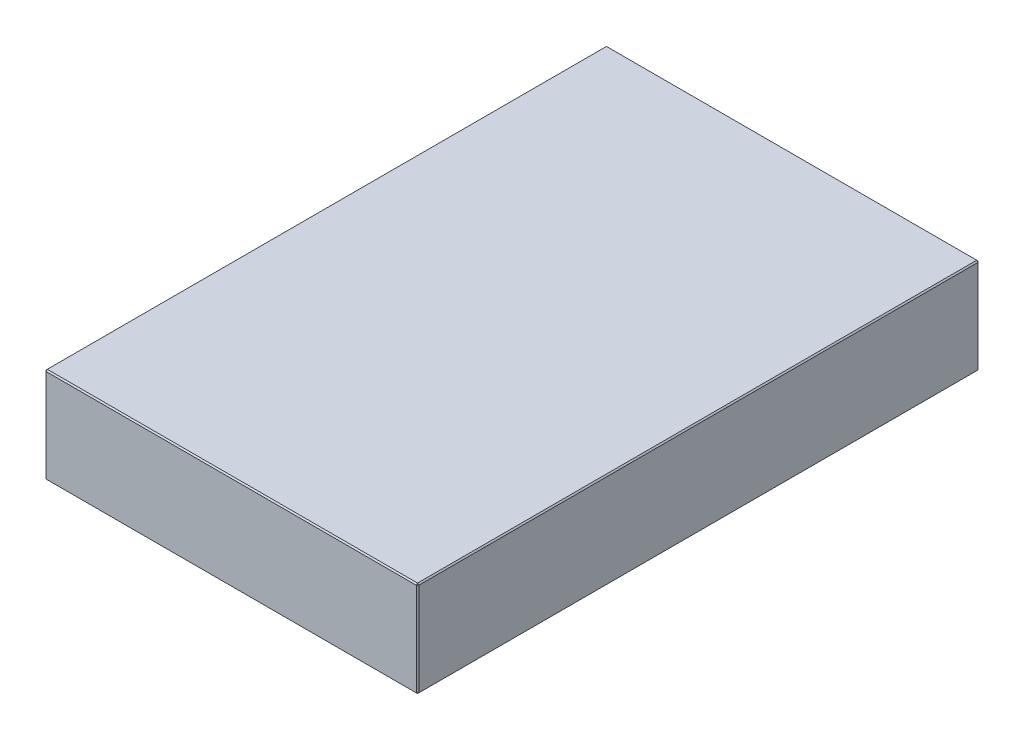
ISO-10303-21;
HEADER;
FILE_DESCRIPTION(('STEP AP214'),'2;1');
FILE_NAME('part.step','',(''),(''),'','','');
FILE_SCHEMA(('AUTOMOTIVE_DESIGN { 1 0 10303 214 1 1 1 1 }'));
ENDSEC;
DATA;
#1=APPLICATION_CONTEXT('core data for automotive mechanical design processes');
#2=APPLICATION_PROTOCOL_DEFINITION('international standard','automotive_design',2000,#1);
#3=PRODUCT_CONTEXT('',#1,'mechanical');
#4=PRODUCT('Part','Part','',(#3));
#5=PRODUCT_RELATED_PRODUCT_CATEGORY('part','',(#4));
#6=PRODUCT_DEFINITION_FORMATION('','',#4);
#7=PRODUCT_DEFINITION_CONTEXT('part definition',#1,'design');
#8=PRODUCT_DEFINITION('design','',#6,#7);
#9=PRODUCT_DEFINITION_SHAPE('','',#8);
#10=(LENGTH_UNIT() NAMED_UNIT(*) SI_UNIT(.MILLI.,.METRE.));
#11=(NAMED_UNIT(*) PLANE_ANGLE_UNIT() SI_UNIT($,.RADIAN.));
#12=(NAMED_UNIT(*) SI_UNIT($,.STERADIAN.) SOLID_ANGLE_UNIT());
#13=UNCERTAINTY_MEASURE_WITH_UNIT(LENGTH_MEASURE(1.E-05),#10,'distance_accuracy_value','');
#14=(GEOMETRIC_REPRESENTATION_CONTEXT(3) GLOBAL_UNCERTAINTY_ASSIGNED_CONTEXT((#13)) GLOBAL_UNIT_ASSIGNED_CONTEXT((#10,
#11,#12)) REPRESENTATION_CONTEXT('',''));
#15=CARTESIAN_POINT('',(0.,0.,0.));
#16=DIRECTION('',(0.,0.,1.));
#17=DIRECTION('',(1.,0.,0.));
#18=AXIS2_PLACEMENT_3D('',#15,#16,#17);
#19=CARTESIAN_POINT('',(-148.,76.,223.));
#20=DIRECTION('',(1.,0.,0.));
#21=DIRECTION('',(0.,0.,-1.));
#22=AXIS2_PLACEMENT_3D('',#19,#20,#21);
#23=PLANE('',#22);
#24=DIRECTION('',(0.,-1.,0.));
#25=VECTOR('',#24,1.);
#26=CARTESIAN_POINT('',(-148.,76.,-222.));
#27=LINE('',#26,#25);
#28=CARTESIAN_POINT('',(-148.,75.,-222.));
#29=VERTEX_POINT('',#28);
#30=CARTESIAN_POINT('',(-148.,1.,-222.));
#31=VERTEX_POINT('',#30);
#32=EDGE_CURVE('E114',#29,#31,#27,.T.);
#33=ORIENTED_EDGE('',*,*,#32,.T.);
#34=DIRECTION('',(0.,0.,1.));
#35=VECTOR('',#34,1.);
#36=CARTESIAN_POINT('',(-148.,1.,223.));
#37=LINE('',#36,#35);
#38=CARTESIAN_POINT('',(-148.,1.,222.));
#39=VERTEX_POINT('',#38);
#40=EDGE_CURVE('E110',#31,#39,#37,.T.);
#41=ORIENTED_EDGE('',*,*,#40,.T.);
#42=DIRECTION('',(0.,1.,0.));
#43=VECTOR('',#42,1.);
#44=CARTESIAN_POINT('',(-148.,76.,222.));
#45=LINE('',#44,#43);
#46=CARTESIAN_POINT('',(-148.,75.,222.));
#47=VERTEX_POINT('',#46);
#48=EDGE_CURVE('E103',#39,#47,#45,.T.);
#49=ORIENTED_EDGE('',*,*,#48,.T.);
#50=DIRECTION('',(0.,0.,-1.));
#51=VECTOR('',#50,1.);
#52=CARTESIAN_POINT('',(-148.,75.,-223.));
#53=LINE('',#52,#51);
#54=EDGE_CURVE('E107',#47,#29,#53,.T.);
#55=ORIENTED_EDGE('',*,*,#54,.T.);
#56=EDGE_LOOP('',(#33,#41,#49,#55));
#57=FACE_BOUND('',#56,.T.);
#58=ADVANCED_FACE('F15',(#57),#23,.F.);
#59=CARTESIAN_POINT('',(148.,76.,223.));
#60=DIRECTION('',(0.,0.,-1.));
#61=DIRECTION('',(-1.,0.,0.));
#62=AXIS2_PLACEMENT_3D('',#59,#60,#61);
#63=PLANE('',#62);
#64=DIRECTION('',(-1.,0.,0.));
#65=VECTOR('',#64,1.);
#66=CARTESIAN_POINT('',(-148.,75.,223.));
#67=LINE('',#66,#65);
#68=CARTESIAN_POINT('',(147.,75.,223.));
#69=VERTEX_POINT('',#68);
#70=CARTESIAN_POINT('',(-147.,75.,223.));
#71=VERTEX_POINT('',#70);
#72=EDGE_CURVE('E164',#69,#71,#67,.T.);
#73=ORIENTED_EDGE('',*,*,#72,.T.);
#74=DIRECTION('',(0.,-1.,0.));
#75=VECTOR('',#74,1.);
#76=CARTESIAN_POINT('',(-147.,76.,223.));
#77=LINE('',#76,#75);
#78=CARTESIAN_POINT('',(-147.,1.00000000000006,223.));
#79=VERTEX_POINT('',#78);
#80=EDGE_CURVE('E122',#71,#79,#77,.T.);
#81=ORIENTED_EDGE('',*,*,#80,.T.);
#82=DIRECTION('',(1.,0.,0.));
#83=VECTOR('',#82,1.);
#84=CARTESIAN_POINT('',(148.,1.00000000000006,223.));
#85=LINE('',#84,#83);
#86=CARTESIAN_POINT('',(147.,1.00000000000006,223.));
#87=VERTEX_POINT('',#86);
#88=EDGE_CURVE('E168',#79,#87,#85,.T.);
#89=ORIENTED_EDGE('',*,*,#88,.T.);
#90=DIRECTION('',(0.,1.,0.));
#91=VECTOR('',#90,1.);
#92=CARTESIAN_POINT('',(147.,76.,223.));
#93=LINE('',#92,#91);
#94=EDGE_CURVE('E166',#87,#69,#93,.T.);
#95=ORIENTED_EDGE('',*,*,#94,.T.);
#96=EDGE_LOOP('',(#73,#81,#89,#95));
#97=FACE_BOUND('',#96,.T.);
#98=ADVANCED_FACE('F275',(#97),#63,.F.);
#99=CARTESIAN_POINT('',(148.,76.,223.));
#100=DIRECTION('',(-1.,0.,0.));
#101=DIRECTION('',(0.,0.,1.));
#102=AXIS2_PLACEMENT_3D('',#99,#100,#101);
#103=PLANE('',#102);
#104=DIRECTION('',(0.,0.,-1.));
#105=VECTOR('',#104,1.);
#106=CARTESIAN_POINT('',(148.,1.00000000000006,223.));
#107=LINE('',#106,#105);
#108=CARTESIAN_POINT('',(148.,1.00000000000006,222.));
#109=VERTEX_POINT('',#108);
#110=CARTESIAN_POINT('',(148.,1.00000000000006,-222.));
#111=VERTEX_POINT('',#110);
#112=EDGE_CURVE('E159',#109,#111,#107,.T.);
#113=ORIENTED_EDGE('',*,*,#112,.T.);
#114=DIRECTION('',(0.,1.,0.));
#115=VECTOR('',#114,1.);
#116=CARTESIAN_POINT('',(148.,76.,-222.));
#117=LINE('',#116,#115);
#118=CARTESIAN_POINT('',(148.,75.,-222.));
#119=VERTEX_POINT('',#118);
#120=EDGE_CURVE('E161',#111,#119,#117,.T.);
#121=ORIENTED_EDGE('',*,*,#120,.T.);
#122=DIRECTION('',(0.,0.,1.));
#123=VECTOR('',#122,1.);
#124=CARTESIAN_POINT('',(148.,75.,223.));
#125=LINE('',#124,#123);
#126=CARTESIAN_POINT('',(148.,75.,222.));
#127=VERTEX_POINT('',#126);
#128=EDGE_CURVE('E155',#119,#127,#125,.T.);
#129=ORIENTED_EDGE('',*,*,#128,.T.);
#130=DIRECTION('',(0.,-1.,0.));
#131=VECTOR('',#130,1.);
#132=CARTESIAN_POINT('',(148.,76.,222.));
#133=LINE('',#132,#131);
#134=EDGE_CURVE('E157',#127,#109,#133,.T.);
#135=ORIENTED_EDGE('',*,*,#134,.T.);
#136=EDGE_LOOP('',(#113,#121,#129,#135));
#137=FACE_BOUND('',#136,.T.);
#138=ADVANCED_FACE('F254',(#137),#103,.F.);
#139=CARTESIAN_POINT('',(148.,76.,-223.));
#140=DIRECTION('',(0.,0.,1.));
#141=DIRECTION('',(1.,0.,0.));
#142=AXIS2_PLACEMENT_3D('',#139,#140,#141);
#143=PLANE('',#142);
#144=DIRECTION('',(0.,-1.,0.));
#145=VECTOR('',#144,1.);
#146=CARTESIAN_POINT('',(147.,76.,-223.));
#147=LINE('',#146,#145);
#148=CARTESIAN_POINT('',(147.,75.,-223.));
#149=VERTEX_POINT('',#148);
#150=CARTESIAN_POINT('',(147.,1.00000000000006,-223.));
#151=VERTEX_POINT('',#150);
#152=EDGE_CURVE('E148',#149,#151,#147,.T.);
#153=ORIENTED_EDGE('',*,*,#152,.T.);
#154=DIRECTION('',(-1.,0.,0.));
#155=VECTOR('',#154,1.);
#156=CARTESIAN_POINT('',(148.,1.00000000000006,-223.));
#157=LINE('',#156,#155);
#158=CARTESIAN_POINT('',(-147.,1.00000000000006,-223.));
#159=VERTEX_POINT('',#158);
#160=EDGE_CURVE('E153',#151,#159,#157,.T.);
#161=ORIENTED_EDGE('',*,*,#160,.T.);
#162=DIRECTION('',(0.,1.,0.));
#163=VECTOR('',#162,1.);
#164=CARTESIAN_POINT('',(-147.,76.,-223.));
#165=LINE('',#164,#163);
#166=CARTESIAN_POINT('',(-147.,75.,-223.));
#167=VERTEX_POINT('',#166);
#168=EDGE_CURVE('E150',#159,#167,#165,.T.);
#169=ORIENTED_EDGE('',*,*,#168,.T.);
#170=DIRECTION('',(1.,0.,0.));
#171=VECTOR('',#170,1.);
#172=CARTESIAN_POINT('',(148.,75.,-223.));
#173=LINE('',#172,#171);
#174=EDGE_CURVE('E146',#167,#149,#173,.T.);
#175=ORIENTED_EDGE('',*,*,#174,.T.);
#176=EDGE_LOOP('',(#153,#161,#169,#175));
#177=FACE_BOUND('',#176,.T.);
#178=ADVANCED_FACE('F284',(#177),#143,.F.);
#179=CARTESIAN_POINT('',(0.,76.,0.));
#180=DIRECTION('',(0.,1.,0.));
#181=DIRECTION('',(0.,0.,1.));
#182=AXIS2_PLACEMENT_3D('',#179,#180,#181);
#183=PLANE('',#182);
#184=DIRECTION('',(0.,0.,-1.));
#185=VECTOR('',#184,1.);
#186=CARTESIAN_POINT('',(147.,76.,-223.));
#187=LINE('',#186,#185);
#188=CARTESIAN_POINT('',(147.,76.,222.));
#189=VERTEX_POINT('',#188);
#190=CARTESIAN_POINT('',(147.,76.,-222.));
#191=VERTEX_POINT('',#190);
#192=EDGE_CURVE('E24',#189,#191,#187,.T.);
#193=ORIENTED_EDGE('',*,*,#192,.T.);
#194=DIRECTION('',(-1.,0.,0.));
#195=VECTOR('',#194,1.);
#196=CARTESIAN_POINT('',(-148.,76.,-222.));
#197=LINE('',#196,#195);
#198=CARTESIAN_POINT('',(-147.,76.,-222.));
#199=VERTEX_POINT('',#198);
#200=EDGE_CURVE('E9',#191,#199,#197,.T.);
#201=ORIENTED_EDGE('',*,*,#200,.T.);
#202=DIRECTION('',(0.,0.,1.));
#203=VECTOR('',#202,1.);
#204=CARTESIAN_POINT('',(-147.,76.,223.));
#205=LINE('',#204,#203);
#206=CARTESIAN_POINT('',(-147.,76.,222.));
#207=VERTEX_POINT('',#206);
#208=EDGE_CURVE('E180',#199,#207,#205,.T.);
#209=ORIENTED_EDGE('',*,*,#208,.T.);
#210=DIRECTION('',(1.,0.,0.));
#211=VECTOR('',#210,1.);
#212=CARTESIAN_POINT('',(148.,76.,222.));
#213=LINE('',#212,#211);
#214=EDGE_CURVE('E35',#207,#189,#213,.T.);
#215=ORIENTED_EDGE('',*,*,#214,.T.);
#216=EDGE_LOOP('',(#193,#201,#209,#215));
#217=FACE_BOUND('',#216,.T.);
#218=ADVANCED_FACE('F350',(#217),#183,.T.);
#219=CARTESIAN_POINT('',(0.,0.,0.));
#220=DIRECTION('',(0.,1.,0.));
#221=DIRECTION('',(0.,0.,1.));
#222=AXIS2_PLACEMENT_3D('',#219,#220,#221);
#223=PLANE('',#222);
#224=DIRECTION('',(0.,0.,1.));
#225=VECTOR('',#224,1.);
#226=CARTESIAN_POINT('',(147.,0.,0.));
#227=LINE('',#226,#225);
#228=CARTESIAN_POINT('',(147.,0.,-222.));
#229=VERTEX_POINT('',#228);
#230=CARTESIAN_POINT('',(147.,0.,222.));
#231=VERTEX_POINT('',#230);
#232=EDGE_CURVE('E171',#229,#231,#227,.T.);
#233=ORIENTED_EDGE('',*,*,#232,.T.);
#234=DIRECTION('',(-1.,0.,0.));
#235=VECTOR('',#234,1.);
#236=CARTESIAN_POINT('',(0.,0.,222.));
#237=LINE('',#236,#235);
#238=CARTESIAN_POINT('',(-147.,0.,222.));
#239=VERTEX_POINT('',#238);
#240=EDGE_CURVE('E177',#231,#239,#237,.T.);
#241=ORIENTED_EDGE('',*,*,#240,.T.);
#242=DIRECTION('',(0.,0.,-1.));
#243=VECTOR('',#242,1.);
#244=CARTESIAN_POINT('',(-147.,0.,0.));
#245=LINE('',#244,#243);
#246=CARTESIAN_POINT('',(-147.,0.,-222.));
#247=VERTEX_POINT('',#246);
#248=EDGE_CURVE('E175',#239,#247,#245,.T.);
#249=ORIENTED_EDGE('',*,*,#248,.T.);
#250=DIRECTION('',(1.,0.,0.));
#251=VECTOR('',#250,1.);
#252=CARTESIAN_POINT('',(0.,0.,-222.));
#253=LINE('',#252,#251);
#254=EDGE_CURVE('E173',#247,#229,#253,.T.);
#255=ORIENTED_EDGE('',*,*,#254,.T.);
#256=EDGE_LOOP('',(#233,#241,#249,#255));
#257=FACE_BOUND('',#256,.T.);
#258=ADVANCED_FACE('F246',(#257),#223,.F.);
#259=CARTESIAN_POINT('',(148.,76.,222.));
#260=DIRECTION('',(-0.707106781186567,0.,-0.707106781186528));
#261=DIRECTION('',(0.,-1.,0.));
#262=AXIS2_PLACEMENT_3D('',#259,#260,#261);
#263=PLANE('',#262);
#264=DIRECTION('',(-0.707106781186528,0.,0.707106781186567));
#265=VECTOR('',#264,1.);
#266=CARTESIAN_POINT('',(147.,75.,223.));
#267=LINE('',#266,#265);
#268=EDGE_CURVE('E19',#69,#127,#267,.F.);
#269=ORIENTED_EDGE('',*,*,#268,.F.);
#270=ORIENTED_EDGE('',*,*,#94,.F.);
#271=DIRECTION('',(0.707106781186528,0.,-0.707106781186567));
#272=VECTOR('',#271,1.);
#273=CARTESIAN_POINT('',(147.,1.00000000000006,223.));
#274=LINE('',#273,#272);
#275=EDGE_CURVE('E142',#109,#87,#274,.F.);
#276=ORIENTED_EDGE('',*,*,#275,.F.);
#277=ORIENTED_EDGE('',*,*,#134,.F.);
#278=EDGE_LOOP('',(#269,#270,#276,#277));
#279=FACE_BOUND('',#278,.T.);
#280=ADVANCED_FACE('F17',(#279),#263,.F.);
#281=CARTESIAN_POINT('',(147.,75.,223.));
#282=DIRECTION('',(0.577350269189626,0.577350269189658,0.577350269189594));
#283=DIRECTION('',(-0.707106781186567,0.707106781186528,0.));
#284=AXIS2_PLACEMENT_3D('',#281,#282,#283);
#285=PLANE('',#284);
#286=DIRECTION('',(0.,-0.707106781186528,0.707106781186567));
#287=VECTOR('',#286,1.);
#288=CARTESIAN_POINT('',(147.,75.,223.));
#289=LINE('',#288,#287);
#290=EDGE_CURVE('E226',#69,#189,#289,.F.);
#291=ORIENTED_EDGE('',*,*,#290,.F.);
#292=ORIENTED_EDGE('',*,*,#268,.T.);
#293=DIRECTION('',(-0.707106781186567,0.707106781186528,0.));
#294=VECTOR('',#293,1.);
#295=CARTESIAN_POINT('',(147.5,75.5,222.));
#296=LINE('',#295,#294);
#297=EDGE_CURVE('E228',#189,#127,#296,.F.);
#298=ORIENTED_EDGE('',*,*,#297,.F.);
#299=EDGE_LOOP('',(#291,#292,#298));
#300=FACE_BOUND('',#299,.T.);
#301=ADVANCED_FACE('F270',(#300),#285,.T.);
#302=CARTESIAN_POINT('',(147.,1.00000000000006,223.));
#303=DIRECTION('',(0.577350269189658,-0.577350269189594,0.577350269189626));
#304=DIRECTION('',(0.707106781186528,0.,-0.707106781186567));
#305=AXIS2_PLACEMENT_3D('',#302,#303,#304);
#306=PLANE('',#305);
#307=DIRECTION('',(-0.707106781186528,-0.707106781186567,0.));
#308=VECTOR('',#307,1.);
#309=CARTESIAN_POINT('',(147.5,0.500000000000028,222.));
#310=LINE('',#309,#308);
#311=EDGE_CURVE('E220',#109,#231,#310,.T.);
#312=ORIENTED_EDGE('',*,*,#311,.F.);
#313=ORIENTED_EDGE('',*,*,#275,.T.);
#314=DIRECTION('',(0.,0.707106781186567,0.707106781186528));
#315=VECTOR('',#314,1.);
#316=CARTESIAN_POINT('',(147.,1.00000000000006,223.));
#317=LINE('',#316,#315);
#318=EDGE_CURVE('E223',#231,#87,#317,.T.);
#319=ORIENTED_EDGE('',*,*,#318,.F.);
#320=EDGE_LOOP('',(#312,#313,#319));
#321=FACE_BOUND('',#320,.T.);
#322=ADVANCED_FACE('F235',(#321),#306,.T.);
#323=CARTESIAN_POINT('',(147.,76.,0.));
#324=DIRECTION('',(0.707106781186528,0.707106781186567,0.));
#325=DIRECTION('',(0.,0.,1.));
#326=AXIS2_PLACEMENT_3D('',#323,#324,#325);
#327=PLANE('',#326);
#328=ORIENTED_EDGE('',*,*,#297,.T.);
#329=ORIENTED_EDGE('',*,*,#128,.F.);
#330=DIRECTION('',(0.707106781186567,-0.707106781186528,0.));
#331=VECTOR('',#330,1.);
#332=CARTESIAN_POINT('',(148.,75.,-222.));
#333=LINE('',#332,#331);
#334=EDGE_CURVE('E215',#191,#119,#333,.T.);
#335=ORIENTED_EDGE('',*,*,#334,.F.);
#336=ORIENTED_EDGE('',*,*,#192,.F.);
#337=EDGE_LOOP('',(#328,#329,#335,#336));
#338=FACE_BOUND('',#337,.T.);
#339=ADVANCED_FACE('F265',(#338),#327,.T.);
#340=CARTESIAN_POINT('',(0.,76.,222.));
#341=DIRECTION('',(0.,0.707106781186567,0.707106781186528));
#342=DIRECTION('',(-1.,0.,0.));
#343=AXIS2_PLACEMENT_3D('',#340,#341,#342);
#344=PLANE('',#343);
#345=ORIENTED_EDGE('',*,*,#290,.T.);
#346=ORIENTED_EDGE('',*,*,#214,.F.);
#347=DIRECTION('',(0.,0.707106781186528,-0.707106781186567));
#348=VECTOR('',#347,1.);
#349=CARTESIAN_POINT('',(-147.,75.5,222.5));
#350=LINE('',#349,#348);
#351=EDGE_CURVE('E126',#71,#207,#350,.T.);
#352=ORIENTED_EDGE('',*,*,#351,.F.);
#353=ORIENTED_EDGE('',*,*,#72,.F.);
#354=EDGE_LOOP('',(#345,#346,#352,#353));
#355=FACE_BOUND('',#354,.T.);
#356=ADVANCED_FACE('F273',(#355),#344,.T.);
#357=CARTESIAN_POINT('',(-147.,76.,223.));
#358=DIRECTION('',(0.707106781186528,0.,-0.707106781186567));
#359=DIRECTION('',(0.,-1.,0.));
#360=AXIS2_PLACEMENT_3D('',#357,#358,#359);
#361=PLANE('',#360);
#362=DIRECTION('',(0.707106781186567,0.,0.707106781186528));
#363=VECTOR('',#362,1.);
#364=CARTESIAN_POINT('',(-147.,1.00000000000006,223.));
#365=LINE('',#364,#363);
#366=EDGE_CURVE('E127',#79,#39,#365,.F.);
#367=ORIENTED_EDGE('',*,*,#366,.F.);
#368=ORIENTED_EDGE('',*,*,#80,.F.);
#369=DIRECTION('',(-0.707106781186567,0.,-0.707106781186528));
#370=VECTOR('',#369,1.);
#371=CARTESIAN_POINT('',(-148.,75.,222.));
#372=LINE('',#371,#370);
#373=EDGE_CURVE('E118',#47,#71,#372,.F.);
#374=ORIENTED_EDGE('',*,*,#373,.F.);
#375=ORIENTED_EDGE('',*,*,#48,.F.);
#376=EDGE_LOOP('',(#367,#368,#374,#375));
#377=FACE_BOUND('',#376,.T.);
#378=ADVANCED_FACE('F120',(#377),#361,.F.);
#379=CARTESIAN_POINT('',(148.,1.00000000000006,223.));
#380=DIRECTION('',(0.,0.707106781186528,-0.707106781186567));
#381=DIRECTION('',(1.,0.,0.));
#382=AXIS2_PLACEMENT_3D('',#379,#380,#381);
#383=PLANE('',#382);
#384=ORIENTED_EDGE('',*,*,#318,.T.);
#385=ORIENTED_EDGE('',*,*,#88,.F.);
#386=DIRECTION('',(0.,-0.707106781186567,-0.707106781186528));
#387=VECTOR('',#386,1.);
#388=CARTESIAN_POINT('',(-147.,1.00000000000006,223.));
#389=LINE('',#388,#387);
#390=EDGE_CURVE('E211',#239,#79,#389,.F.);
#391=ORIENTED_EDGE('',*,*,#390,.F.);
#392=ORIENTED_EDGE('',*,*,#240,.F.);
#393=EDGE_LOOP('',(#384,#385,#391,#392));
#394=FACE_BOUND('',#393,.T.);
#395=ADVANCED_FACE('F243',(#394),#383,.F.);
#396=CARTESIAN_POINT('',(148.,1.00000000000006,223.));
#397=DIRECTION('',(-0.707106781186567,0.707106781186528,0.));
#398=DIRECTION('',(0.,0.,-1.));
#399=AXIS2_PLACEMENT_3D('',#396,#397,#398);
#400=PLANE('',#399);
#401=ORIENTED_EDGE('',*,*,#311,.T.);
#402=ORIENTED_EDGE('',*,*,#232,.F.);
#403=DIRECTION('',(0.707106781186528,0.707106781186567,0.));
#404=VECTOR('',#403,1.);
#405=CARTESIAN_POINT('',(147.5,0.500000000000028,-222.));
#406=LINE('',#405,#404);
#407=EDGE_CURVE('E208',#111,#229,#406,.F.);
#408=ORIENTED_EDGE('',*,*,#407,.F.);
#409=ORIENTED_EDGE('',*,*,#112,.F.);
#410=EDGE_LOOP('',(#401,#402,#408,#409));
#411=FACE_BOUND('',#410,.T.);
#412=ADVANCED_FACE('F251',(#411),#400,.F.);
#413=CARTESIAN_POINT('',(147.,76.,-223.));
#414=DIRECTION('',(-0.707106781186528,0.,0.707106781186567));
#415=DIRECTION('',(0.,-1.,0.));
#416=AXIS2_PLACEMENT_3D('',#413,#414,#415);
#417=PLANE('',#416);
#418=DIRECTION('',(0.707106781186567,0.,0.707106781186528));
#419=VECTOR('',#418,1.);
#420=CARTESIAN_POINT('',(148.,75.,-222.));
#421=LINE('',#420,#419);
#422=EDGE_CURVE('E217',#119,#149,#421,.F.);
#423=ORIENTED_EDGE('',*,*,#422,.F.);
#424=ORIENTED_EDGE('',*,*,#120,.F.);
#425=DIRECTION('',(-0.707106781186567,0.,-0.707106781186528));
#426=VECTOR('',#425,1.);
#427=CARTESIAN_POINT('',(147.,1.00000000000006,-223.));
#428=LINE('',#427,#426);
#429=EDGE_CURVE('E205',#151,#111,#428,.F.);
#430=ORIENTED_EDGE('',*,*,#429,.F.);
#431=ORIENTED_EDGE('',*,*,#152,.F.);
#432=EDGE_LOOP('',(#423,#424,#430,#431));
#433=FACE_BOUND('',#432,.T.);
#434=ADVANCED_FACE('F258',(#433),#417,.F.);
#435=CARTESIAN_POINT('',(148.,75.,-222.));
#436=DIRECTION('',(0.577350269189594,0.577350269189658,-0.577350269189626));
#437=DIRECTION('',(0.,0.707106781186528,0.707106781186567));
#438=AXIS2_PLACEMENT_3D('',#435,#436,#437);
#439=PLANE('',#438);
#440=ORIENTED_EDGE('',*,*,#334,.T.);
#441=ORIENTED_EDGE('',*,*,#422,.T.);
#442=DIRECTION('',(0.,0.707106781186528,0.707106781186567));
#443=VECTOR('',#442,1.);
#444=CARTESIAN_POINT('',(147.,75.5,-222.5));
#445=LINE('',#444,#443);
#446=EDGE_CURVE('E134',#191,#149,#445,.F.);
#447=ORIENTED_EDGE('',*,*,#446,.F.);
#448=EDGE_LOOP('',(#440,#441,#447));
#449=FACE_BOUND('',#448,.T.);
#450=ADVANCED_FACE('F325',(#449),#439,.T.);
#451=CARTESIAN_POINT('',(-148.,75.,222.));
#452=DIRECTION('',(-0.577350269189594,0.577350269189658,0.577350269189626));
#453=DIRECTION('',(0.,-0.707106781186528,0.707106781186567));
#454=AXIS2_PLACEMENT_3D('',#451,#452,#453);
#455=PLANE('',#454);
#456=ORIENTED_EDGE('',*,*,#373,.T.);
#457=ORIENTED_EDGE('',*,*,#351,.T.);
#458=DIRECTION('',(-0.707106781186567,-0.707106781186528,0.));
#459=VECTOR('',#458,1.);
#460=CARTESIAN_POINT('',(-148.,75.,222.));
#461=LINE('',#460,#459);
#462=EDGE_CURVE('E130',#47,#207,#461,.F.);
#463=ORIENTED_EDGE('',*,*,#462,.F.);
#464=EDGE_LOOP('',(#456,#457,#463));
#465=FACE_BOUND('',#464,.T.);
#466=ADVANCED_FACE('F131',(#465),#455,.T.);
#467=CARTESIAN_POINT('',(-147.,1.00000000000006,223.));
#468=DIRECTION('',(-0.577350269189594,-0.577350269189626,0.577350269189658));
#469=DIRECTION('',(0.,-0.707106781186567,-0.707106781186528));
#470=AXIS2_PLACEMENT_3D('',#467,#468,#469);
#471=PLANE('',#470);
#472=ORIENTED_EDGE('',*,*,#390,.T.);
#473=ORIENTED_EDGE('',*,*,#366,.T.);
#474=DIRECTION('',(-0.707106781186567,0.707106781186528,0.));
#475=VECTOR('',#474,1.);
#476=CARTESIAN_POINT('',(-147.5,0.5,222.));
#477=LINE('',#476,#475);
#478=EDGE_CURVE('E135',#239,#39,#477,.T.);
#479=ORIENTED_EDGE('',*,*,#478,.F.);
#480=EDGE_LOOP('',(#472,#473,#479));
#481=FACE_BOUND('',#480,.T.);
#482=ADVANCED_FACE('F318',(#481),#471,.T.);
#483=CARTESIAN_POINT('',(147.,1.00000000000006,-223.));
#484=DIRECTION('',(0.577350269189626,-0.577350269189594,-0.577350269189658));
#485=DIRECTION('',(-0.707106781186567,0.,-0.707106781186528));
#486=AXIS2_PLACEMENT_3D('',#483,#484,#485);
#487=PLANE('',#486);
#488=ORIENTED_EDGE('',*,*,#429,.T.);
#489=ORIENTED_EDGE('',*,*,#407,.T.);
#490=DIRECTION('',(0.,-0.707106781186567,0.707106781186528));
#491=VECTOR('',#490,1.);
#492=CARTESIAN_POINT('',(147.,1.00000000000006,-223.));
#493=LINE('',#492,#491);
#494=EDGE_CURVE('E198',#151,#229,#493,.T.);
#495=ORIENTED_EDGE('',*,*,#494,.F.);
#496=EDGE_LOOP('',(#488,#489,#495));
#497=FACE_BOUND('',#496,.T.);
#498=ADVANCED_FACE('F314',(#497),#487,.T.);
#499=CARTESIAN_POINT('',(0.,76.,-222.));
#500=DIRECTION('',(0.,0.707106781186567,-0.707106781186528));
#501=DIRECTION('',(1.,0.,0.));
#502=AXIS2_PLACEMENT_3D('',#499,#500,#501);
#503=PLANE('',#502);
#504=ORIENTED_EDGE('',*,*,#446,.T.);
#505=ORIENTED_EDGE('',*,*,#174,.F.);
#506=DIRECTION('',(0.,-0.707106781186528,-0.707106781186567));
#507=VECTOR('',#506,1.);
#508=CARTESIAN_POINT('',(-147.,75.,-223.));
#509=LINE('',#508,#507);
#510=EDGE_CURVE('E195',#199,#167,#509,.T.);
#511=ORIENTED_EDGE('',*,*,#510,.F.);
#512=ORIENTED_EDGE('',*,*,#200,.F.);
#513=EDGE_LOOP('',(#504,#505,#511,#512));
#514=FACE_BOUND('',#513,.T.);
#515=ADVANCED_FACE('F311',(#514),#503,.T.);
#516=CARTESIAN_POINT('',(-147.,76.,0.));
#517=DIRECTION('',(-0.707106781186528,0.707106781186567,0.));
#518=DIRECTION('',(0.,0.,-1.));
#519=AXIS2_PLACEMENT_3D('',#516,#517,#518);
#520=PLANE('',#519);
#521=ORIENTED_EDGE('',*,*,#462,.T.);
#522=ORIENTED_EDGE('',*,*,#208,.F.);
#523=DIRECTION('',(0.707106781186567,0.707106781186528,0.));
#524=VECTOR('',#523,1.);
#525=CARTESIAN_POINT('',(-147.5,75.5,-222.));
#526=LINE('',#525,#524);
#527=EDGE_CURVE('E138',#29,#199,#526,.T.);
#528=ORIENTED_EDGE('',*,*,#527,.F.);
#529=ORIENTED_EDGE('',*,*,#54,.F.);
#530=EDGE_LOOP('',(#521,#522,#528,#529));
#531=FACE_BOUND('',#530,.T.);
#532=ADVANCED_FACE('F137',(#531),#520,.T.);
#533=CARTESIAN_POINT('',(-148.,1.,223.));
#534=DIRECTION('',(0.707106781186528,0.707106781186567,0.));
#535=DIRECTION('',(0.,0.,1.));
#536=AXIS2_PLACEMENT_3D('',#533,#534,#535);
#537=PLANE('',#536);
#538=ORIENTED_EDGE('',*,*,#478,.T.);
#539=ORIENTED_EDGE('',*,*,#40,.F.);
#540=DIRECTION('',(0.707106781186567,-0.707106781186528,0.));
#541=VECTOR('',#540,1.);
#542=CARTESIAN_POINT('',(-148.,1.,-222.));
#543=LINE('',#542,#541);
#544=EDGE_CURVE('E191',#247,#31,#543,.F.);
#545=ORIENTED_EDGE('',*,*,#544,.F.);
#546=ORIENTED_EDGE('',*,*,#248,.F.);
#547=EDGE_LOOP('',(#538,#539,#545,#546));
#548=FACE_BOUND('',#547,.T.);
#549=ADVANCED_FACE('F304',(#548),#537,.F.);
#550=CARTESIAN_POINT('',(148.,1.00000000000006,-223.));
#551=DIRECTION('',(0.,0.707106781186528,0.707106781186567));
#552=DIRECTION('',(-1.,0.,0.));
#553=AXIS2_PLACEMENT_3D('',#550,#551,#552);
#554=PLANE('',#553);
#555=ORIENTED_EDGE('',*,*,#494,.T.);
#556=ORIENTED_EDGE('',*,*,#254,.F.);
#557=DIRECTION('',(0.,0.707106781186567,-0.707106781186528));
#558=VECTOR('',#557,1.);
#559=CARTESIAN_POINT('',(-147.,0.500000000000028,-222.5));
#560=LINE('',#559,#558);
#561=EDGE_CURVE('E188',#159,#247,#560,.F.);
#562=ORIENTED_EDGE('',*,*,#561,.F.);
#563=ORIENTED_EDGE('',*,*,#160,.F.);
#564=EDGE_LOOP('',(#555,#556,#562,#563));
#565=FACE_BOUND('',#564,.T.);
#566=ADVANCED_FACE('F300',(#565),#554,.F.);
#567=CARTESIAN_POINT('',(-147.,75.,-223.));
#568=DIRECTION('',(-0.577350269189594,0.577350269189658,-0.577350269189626));
#569=DIRECTION('',(0.,0.707106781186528,0.707106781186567));
#570=AXIS2_PLACEMENT_3D('',#567,#568,#569);
#571=PLANE('',#570);
#572=ORIENTED_EDGE('',*,*,#527,.T.);
#573=ORIENTED_EDGE('',*,*,#510,.T.);
#574=DIRECTION('',(0.707106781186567,0.,-0.707106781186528));
#575=VECTOR('',#574,1.);
#576=CARTESIAN_POINT('',(-147.,75.,-223.));
#577=LINE('',#576,#575);
#578=EDGE_CURVE('E186',#29,#167,#577,.T.);
#579=ORIENTED_EDGE('',*,*,#578,.F.);
#580=EDGE_LOOP('',(#572,#573,#579));
#581=FACE_BOUND('',#580,.T.);
#582=ADVANCED_FACE('F296',(#581),#571,.T.);
#583=CARTESIAN_POINT('',(-148.,1.,-222.));
#584=DIRECTION('',(-0.577350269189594,-0.577350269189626,-0.577350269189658));
#585=DIRECTION('',(0.,0.707106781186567,-0.707106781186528));
#586=AXIS2_PLACEMENT_3D('',#583,#584,#585);
#587=PLANE('',#586);
#588=ORIENTED_EDGE('',*,*,#561,.T.);
#589=ORIENTED_EDGE('',*,*,#544,.T.);
#590=DIRECTION('',(-0.707106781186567,0.,0.707106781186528));
#591=VECTOR('',#590,1.);
#592=CARTESIAN_POINT('',(-148.,1.,-222.));
#593=LINE('',#592,#591);
#594=EDGE_CURVE('E184',#159,#31,#593,.T.);
#595=ORIENTED_EDGE('',*,*,#594,.F.);
#596=EDGE_LOOP('',(#588,#589,#595));
#597=FACE_BOUND('',#596,.T.);
#598=ADVANCED_FACE('F292',(#597),#587,.T.);
#599=CARTESIAN_POINT('',(-148.,76.,-222.));
#600=DIRECTION('',(0.707106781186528,0.,0.707106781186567));
#601=DIRECTION('',(0.,-1.,0.));
#602=AXIS2_PLACEMENT_3D('',#599,#600,#601);
#603=PLANE('',#602);
#604=ORIENTED_EDGE('',*,*,#578,.T.);
#605=ORIENTED_EDGE('',*,*,#168,.F.);
#606=ORIENTED_EDGE('',*,*,#594,.T.);
#607=ORIENTED_EDGE('',*,*,#32,.F.);
#608=EDGE_LOOP('',(#604,#605,#606,#607));
#609=FACE_BOUND('',#608,.T.);
#610=ADVANCED_FACE('F289',(#609),#603,.F.);
#611=CLOSED_SHELL('',(#58,#98,#138,#178,#218,#258,#280,#301,#322,#339,#356,#378,#395,#412,#434,
#450,#466,#482,#498,#515,#532,#549,#566,#582,#598,#610));
#612=MANIFOLD_SOLID_BREP('B1',#611);
#613=ADVANCED_BREP_SHAPE_REPRESENTATION('',(#18,#612),#14);
#614=SHAPE_DEFINITION_REPRESENTATION(#9,#613);
ENDSEC;
END-ISO-10303-21;
